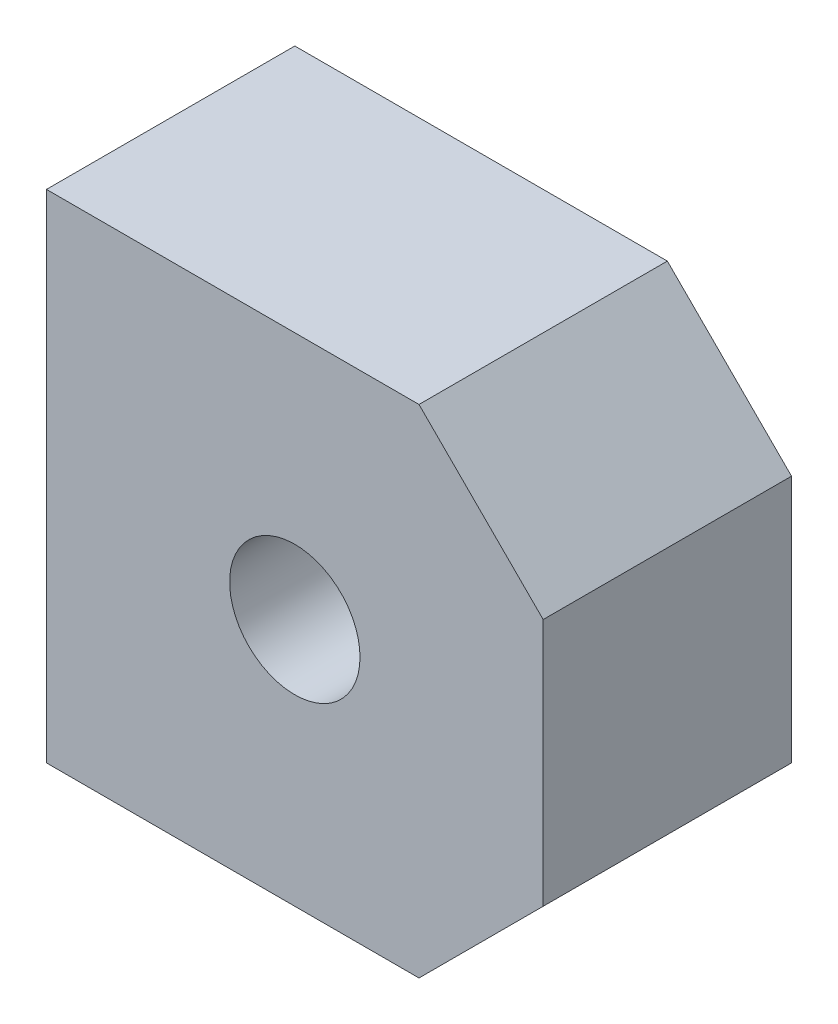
ISO-10303-21;
HEADER;
FILE_DESCRIPTION(('STEP AP214'),'2;1');
FILE_NAME('part.step','',(''),(''),'','','');
FILE_SCHEMA(('AUTOMOTIVE_DESIGN { 1 0 10303 214 1 1 1 1 }'));
ENDSEC;
DATA;
#1=APPLICATION_CONTEXT('core data for automotive mechanical design processes');
#2=APPLICATION_PROTOCOL_DEFINITION('international standard','automotive_design',2000,#1);
#3=PRODUCT_CONTEXT('',#1,'mechanical');
#4=PRODUCT('Part','Part','',(#3));
#5=PRODUCT_RELATED_PRODUCT_CATEGORY('part','',(#4));
#6=PRODUCT_DEFINITION_FORMATION('','',#4);
#7=PRODUCT_DEFINITION_CONTEXT('part definition',#1,'design');
#8=PRODUCT_DEFINITION('design','',#6,#7);
#9=PRODUCT_DEFINITION_SHAPE('','',#8);
#10=(LENGTH_UNIT() NAMED_UNIT(*) SI_UNIT(.MILLI.,.METRE.));
#11=(NAMED_UNIT(*) PLANE_ANGLE_UNIT() SI_UNIT($,.RADIAN.));
#12=(NAMED_UNIT(*) SI_UNIT($,.STERADIAN.) SOLID_ANGLE_UNIT());
#13=UNCERTAINTY_MEASURE_WITH_UNIT(LENGTH_MEASURE(1.E-05),#10,'distance_accuracy_value','');
#14=(GEOMETRIC_REPRESENTATION_CONTEXT(3) GLOBAL_UNCERTAINTY_ASSIGNED_CONTEXT((#13)) GLOBAL_UNIT_ASSIGNED_CONTEXT((#10,
#11,#12)) REPRESENTATION_CONTEXT('',''));
#15=CARTESIAN_POINT('',(0.,0.,0.));
#16=DIRECTION('',(0.,0.,1.));
#17=DIRECTION('',(1.,0.,0.));
#18=AXIS2_PLACEMENT_3D('',#15,#16,#17);
#19=CARTESIAN_POINT('',(0.,0.,20.));
#20=DIRECTION('',(1.,0.,0.));
#21=DIRECTION('',(0.,0.,-1.));
#22=AXIS2_PLACEMENT_3D('',#19,#20,#21);
#23=PLANE('',#22);
#24=DIRECTION('',(0.,-1.,0.));
#25=VECTOR('',#24,1.);
#26=CARTESIAN_POINT('',(0.,0.,0.));
#27=LINE('',#26,#25);
#28=CARTESIAN_POINT('',(0.,40.,0.));
#29=VERTEX_POINT('',#28);
#30=CARTESIAN_POINT('',(0.,0.,0.));
#31=VERTEX_POINT('',#30);
#32=EDGE_CURVE('E86',#29,#31,#27,.T.);
#33=ORIENTED_EDGE('',*,*,#32,.T.);
#34=DIRECTION('',(0.,0.,-1.));
#35=VECTOR('',#34,1.);
#36=CARTESIAN_POINT('',(0.,0.,20.));
#37=LINE('',#36,#35);
#38=CARTESIAN_POINT('',(0.,0.,20.));
#39=VERTEX_POINT('',#38);
#40=EDGE_CURVE('E91',#39,#31,#37,.T.);
#41=ORIENTED_EDGE('',*,*,#40,.F.);
#42=DIRECTION('',(0.,-1.,0.));
#43=VECTOR('',#42,1.);
#44=CARTESIAN_POINT('',(0.,0.,20.));
#45=LINE('',#44,#43);
#46=CARTESIAN_POINT('',(0.,40.,20.));
#47=VERTEX_POINT('',#46);
#48=EDGE_CURVE('E111',#47,#39,#45,.T.);
#49=ORIENTED_EDGE('',*,*,#48,.F.);
#50=DIRECTION('',(0.,0.,-1.));
#51=VECTOR('',#50,1.);
#52=CARTESIAN_POINT('',(0.,40.,20.));
#53=LINE('',#52,#51);
#54=EDGE_CURVE('E98',#47,#29,#53,.T.);
#55=ORIENTED_EDGE('',*,*,#54,.T.);
#56=EDGE_LOOP('',(#33,#41,#49,#55));
#57=FACE_BOUND('',#56,.T.);
#58=ADVANCED_FACE('F26',(#57),#23,.F.);
#59=CARTESIAN_POINT('',(0.,0.,20.));
#60=DIRECTION('',(0.,1.,0.));
#61=DIRECTION('',(0.,0.,1.));
#62=AXIS2_PLACEMENT_3D('',#59,#60,#61);
#63=PLANE('',#62);
#64=DIRECTION('',(1.,0.,0.));
#65=VECTOR('',#64,1.);
#66=CARTESIAN_POINT('',(0.,0.,0.));
#67=LINE('',#66,#65);
#68=CARTESIAN_POINT('',(30.,0.,0.));
#69=VERTEX_POINT('',#68);
#70=EDGE_CURVE('E80',#31,#69,#67,.T.);
#71=ORIENTED_EDGE('',*,*,#70,.T.);
#72=DIRECTION('',(0.,0.,1.));
#73=VECTOR('',#72,1.);
#74=CARTESIAN_POINT('',(30.,0.,20.));
#75=LINE('',#74,#73);
#76=CARTESIAN_POINT('',(30.,0.,20.));
#77=VERTEX_POINT('',#76);
#78=EDGE_CURVE('E49',#69,#77,#75,.T.);
#79=ORIENTED_EDGE('',*,*,#78,.T.);
#80=DIRECTION('',(1.,0.,0.));
#81=VECTOR('',#80,1.);
#82=CARTESIAN_POINT('',(0.,0.,20.));
#83=LINE('',#82,#81);
#84=EDGE_CURVE('E93',#39,#77,#83,.T.);
#85=ORIENTED_EDGE('',*,*,#84,.F.);
#86=ORIENTED_EDGE('',*,*,#40,.T.);
#87=EDGE_LOOP('',(#71,#79,#85,#86));
#88=FACE_BOUND('',#87,.T.);
#89=ADVANCED_FACE('F92',(#88),#63,.F.);
#90=CARTESIAN_POINT('',(40.,0.,20.));
#91=DIRECTION('',(-1.,0.,0.));
#92=DIRECTION('',(0.,-1.,0.));
#93=AXIS2_PLACEMENT_3D('',#90,#91,#92);
#94=PLANE('',#93);
#95=DIRECTION('',(0.,1.,0.));
#96=VECTOR('',#95,1.);
#97=CARTESIAN_POINT('',(40.,0.,20.));
#98=LINE('',#97,#96);
#99=CARTESIAN_POINT('',(40.,9.99999999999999,20.));
#100=VERTEX_POINT('',#99);
#101=CARTESIAN_POINT('',(40.,30.,20.));
#102=VERTEX_POINT('',#101);
#103=EDGE_CURVE('E114',#100,#102,#98,.T.);
#104=ORIENTED_EDGE('',*,*,#103,.F.);
#105=DIRECTION('',(0.,0.,-1.));
#106=VECTOR('',#105,1.);
#107=CARTESIAN_POINT('',(40.,9.99999999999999,20.));
#108=LINE('',#107,#106);
#109=CARTESIAN_POINT('',(40.,9.99999999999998,0.));
#110=VERTEX_POINT('',#109);
#111=EDGE_CURVE('E120',#100,#110,#108,.T.);
#112=ORIENTED_EDGE('',*,*,#111,.T.);
#113=DIRECTION('',(0.,1.,0.));
#114=VECTOR('',#113,1.);
#115=CARTESIAN_POINT('',(40.,0.,0.));
#116=LINE('',#115,#114);
#117=CARTESIAN_POINT('',(40.,29.9999999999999,0.));
#118=VERTEX_POINT('',#117);
#119=EDGE_CURVE('E88',#110,#118,#116,.T.);
#120=ORIENTED_EDGE('',*,*,#119,.T.);
#121=DIRECTION('',(0.,0.,1.));
#122=VECTOR('',#121,1.);
#123=CARTESIAN_POINT('',(40.,29.9999999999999,20.));
#124=LINE('',#123,#122);
#125=EDGE_CURVE('E97',#118,#102,#124,.T.);
#126=ORIENTED_EDGE('',*,*,#125,.T.);
#127=EDGE_LOOP('',(#104,#112,#120,#126));
#128=FACE_BOUND('',#127,.T.);
#129=ADVANCED_FACE('F134',(#128),#94,.F.);
#130=CARTESIAN_POINT('',(0.,40.,20.));
#131=DIRECTION('',(0.,-1.,0.));
#132=DIRECTION('',(0.,0.,-1.));
#133=AXIS2_PLACEMENT_3D('',#130,#131,#132);
#134=PLANE('',#133);
#135=DIRECTION('',(-1.,0.,0.));
#136=VECTOR('',#135,1.);
#137=CARTESIAN_POINT('',(0.,40.,20.));
#138=LINE('',#137,#136);
#139=CARTESIAN_POINT('',(30.,40.,20.));
#140=VERTEX_POINT('',#139);
#141=EDGE_CURVE('E116',#140,#47,#138,.T.);
#142=ORIENTED_EDGE('',*,*,#141,.F.);
#143=DIRECTION('',(0.,0.,-1.));
#144=VECTOR('',#143,1.);
#145=CARTESIAN_POINT('',(30.,40.,20.));
#146=LINE('',#145,#144);
#147=CARTESIAN_POINT('',(30.,40.,0.));
#148=VERTEX_POINT('',#147);
#149=EDGE_CURVE('E11',#140,#148,#146,.T.);
#150=ORIENTED_EDGE('',*,*,#149,.T.);
#151=DIRECTION('',(-1.,0.,0.));
#152=VECTOR('',#151,1.);
#153=CARTESIAN_POINT('',(0.,40.,0.));
#154=LINE('',#153,#152);
#155=EDGE_CURVE('E109',#148,#29,#154,.T.);
#156=ORIENTED_EDGE('',*,*,#155,.T.);
#157=ORIENTED_EDGE('',*,*,#54,.F.);
#158=EDGE_LOOP('',(#142,#150,#156,#157));
#159=FACE_BOUND('',#158,.T.);
#160=ADVANCED_FACE('F157',(#159),#134,.F.);
#161=CARTESIAN_POINT('',(0.,40.,20.));
#162=DIRECTION('',(0.,0.,-1.));
#163=DIRECTION('',(-1.,0.,0.));
#164=AXIS2_PLACEMENT_3D('',#161,#162,#163);
#165=PLANE('',#164);
#166=CARTESIAN_POINT('',(20.,20.,20.));
#167=DIRECTION('',(0.,0.,1.));
#168=DIRECTION('',(1.,0.,0.));
#169=AXIS2_PLACEMENT_3D('',#166,#167,#168);
#170=CIRCLE('',#169,5.24999999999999);
#171=CARTESIAN_POINT('',(25.25,20.,20.));
#172=VERTEX_POINT('',#171);
#173=EDGE_CURVE('E104',#172,#172,#170,.T.);
#174=ORIENTED_EDGE('',*,*,#173,.F.);
#175=EDGE_LOOP('',(#174));
#176=FACE_BOUND('',#175,.T.);
#177=ORIENTED_EDGE('',*,*,#84,.T.);
#178=DIRECTION('',(-0.707106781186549,-0.707106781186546,0.));
#179=VECTOR('',#178,1.);
#180=CARTESIAN_POINT('',(40.,9.99999999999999,20.));
#181=LINE('',#180,#179);
#182=EDGE_CURVE('E34',#77,#100,#181,.F.);
#183=ORIENTED_EDGE('',*,*,#182,.T.);
#184=ORIENTED_EDGE('',*,*,#103,.T.);
#185=DIRECTION('',(0.707106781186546,-0.707106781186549,0.));
#186=VECTOR('',#185,1.);
#187=CARTESIAN_POINT('',(30.,40.,20.));
#188=LINE('',#187,#186);
#189=EDGE_CURVE('E41',#102,#140,#188,.F.);
#190=ORIENTED_EDGE('',*,*,#189,.T.);
#191=ORIENTED_EDGE('',*,*,#141,.T.);
#192=ORIENTED_EDGE('',*,*,#48,.T.);
#193=EDGE_LOOP('',(#177,#183,#184,#190,#191,#192));
#194=FACE_BOUND('',#193,.T.);
#195=ADVANCED_FACE('F130',(#176,#194),#165,.F.);
#196=CARTESIAN_POINT('',(0.,40.,0.));
#197=DIRECTION('',(0.,0.,-1.));
#198=DIRECTION('',(-1.,0.,0.));
#199=AXIS2_PLACEMENT_3D('',#196,#197,#198);
#200=PLANE('',#199);
#201=CARTESIAN_POINT('',(20.,20.,0.));
#202=DIRECTION('',(0.,0.,-1.));
#203=DIRECTION('',(-1.,0.,0.));
#204=AXIS2_PLACEMENT_3D('',#201,#202,#203);
#205=CIRCLE('',#204,5.24999999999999);
#206=CARTESIAN_POINT('',(14.75,20.,0.));
#207=VERTEX_POINT('',#206);
#208=EDGE_CURVE('E29',#207,#207,#205,.T.);
#209=ORIENTED_EDGE('',*,*,#208,.F.);
#210=EDGE_LOOP('',(#209));
#211=FACE_BOUND('',#210,.T.);
#212=ORIENTED_EDGE('',*,*,#119,.F.);
#213=DIRECTION('',(0.707106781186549,0.707106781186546,0.));
#214=VECTOR('',#213,1.);
#215=CARTESIAN_POINT('',(34.9999999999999,4.99999999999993,0.));
#216=LINE('',#215,#214);
#217=EDGE_CURVE('E87',#110,#69,#216,.F.);
#218=ORIENTED_EDGE('',*,*,#217,.T.);
#219=ORIENTED_EDGE('',*,*,#70,.F.);
#220=ORIENTED_EDGE('',*,*,#32,.F.);
#221=ORIENTED_EDGE('',*,*,#155,.F.);
#222=DIRECTION('',(-0.707106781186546,0.707106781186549,0.));
#223=VECTOR('',#222,1.);
#224=CARTESIAN_POINT('',(15.,55.,0.));
#225=LINE('',#224,#223);
#226=EDGE_CURVE('E123',#148,#118,#225,.F.);
#227=ORIENTED_EDGE('',*,*,#226,.T.);
#228=EDGE_LOOP('',(#212,#218,#219,#220,#221,#227));
#229=FACE_BOUND('',#228,.T.);
#230=ADVANCED_FACE('F83',(#211,#229),#200,.T.);
#231=CARTESIAN_POINT('',(40.,9.99999999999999,20.));
#232=DIRECTION('',(-0.707106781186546,0.707106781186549,0.));
#233=DIRECTION('',(-0.707106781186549,-0.707106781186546,0.));
#234=AXIS2_PLACEMENT_3D('',#231,#232,#233);
#235=PLANE('',#234);
#236=ORIENTED_EDGE('',*,*,#182,.F.);
#237=ORIENTED_EDGE('',*,*,#78,.F.);
#238=ORIENTED_EDGE('',*,*,#217,.F.);
#239=ORIENTED_EDGE('',*,*,#111,.F.);
#240=EDGE_LOOP('',(#236,#237,#238,#239));
#241=FACE_BOUND('',#240,.T.);
#242=ADVANCED_FACE('F136',(#241),#235,.F.);
#243=CARTESIAN_POINT('',(30.,40.,20.));
#244=DIRECTION('',(-0.707106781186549,-0.707106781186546,0.));
#245=DIRECTION('',(0.707106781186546,-0.707106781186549,0.));
#246=AXIS2_PLACEMENT_3D('',#243,#244,#245);
#247=PLANE('',#246);
#248=ORIENTED_EDGE('',*,*,#189,.F.);
#249=ORIENTED_EDGE('',*,*,#125,.F.);
#250=ORIENTED_EDGE('',*,*,#226,.F.);
#251=ORIENTED_EDGE('',*,*,#149,.F.);
#252=EDGE_LOOP('',(#248,#249,#250,#251));
#253=FACE_BOUND('',#252,.T.);
#254=ADVANCED_FACE('F138',(#253),#247,.F.);
#255=CARTESIAN_POINT('',(20.,20.,20.));
#256=DIRECTION('',(0.,0.,1.));
#257=DIRECTION('',(1.,0.,0.));
#258=AXIS2_PLACEMENT_3D('',#255,#256,#257);
#259=CYLINDRICAL_SURFACE('',#258,5.24999999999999);
#260=ORIENTED_EDGE('',*,*,#208,.T.);
#261=EDGE_LOOP('',(#260));
#262=FACE_BOUND('',#261,.T.);
#263=ORIENTED_EDGE('',*,*,#173,.T.);
#264=EDGE_LOOP('',(#263));
#265=FACE_BOUND('',#264,.T.);
#266=ADVANCED_FACE('F144',(#262,#265),#259,.F.);
#267=CLOSED_SHELL('',(#58,#89,#129,#160,#195,#230,#242,#254,#266));
#268=MANIFOLD_SOLID_BREP('B2',#267);
#269=ADVANCED_BREP_SHAPE_REPRESENTATION('',(#18,#268),#14);
#270=SHAPE_DEFINITION_REPRESENTATION(#9,#269);
ENDSEC;
END-ISO-10303-21;
